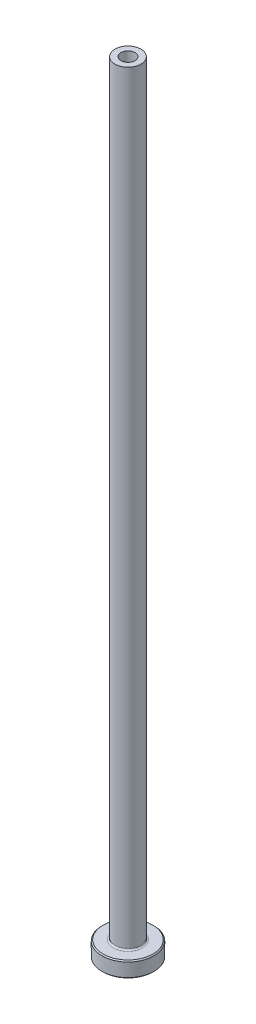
from build123d import *

# Parameters (mm, degrees)
FILLET1_R     = 0.3
CHAMFER1_SIZE = 0.2
CHAMFER3_SIZE = 0.5


with BuildPart() as part:
    # Sketch1 → Revolve1 (revolve)
    with BuildSketch(Plane.XY, mode=Mode.PRIVATE) as revolve1_sk:
        Polygon((-1.35, 150), (-2.5, 150), (-2.5, 3), (-5, 3), (-5, 0), (-1.6, 0), (-1.6, 93), (-1.35, 105), align=None)
    revolve(revolve1_sk.sketch.rotate(Axis((0, 92.187680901, 0), (0, -1, 0)), 270), axis=Axis((0, 92.187680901, 0), (0, -1, 0)))

    # Fillet1
    fillet1_edges = [part.edges().sort_by_distance(p)[0] for p in [
        (0, 3, -2.5),
    ]]
    fillet(fillet1_edges, radius=FILLET1_R)

    # Chamfer1
    chamfer1_edges = [part.edges().sort_by_distance(p)[0] for p in [
        (0, 0, -5),
        (0, 3, -5),
    ]]
    chamfer(chamfer1_edges, length=CHAMFER1_SIZE)

    # Chamfer3
    chamfer3_edges = [part.edges().sort_by_distance(p)[0] for p in [
        (0, 0, -1.6),
    ]]
    chamfer(chamfer3_edges, length=CHAMFER3_SIZE)


solid = part.part
